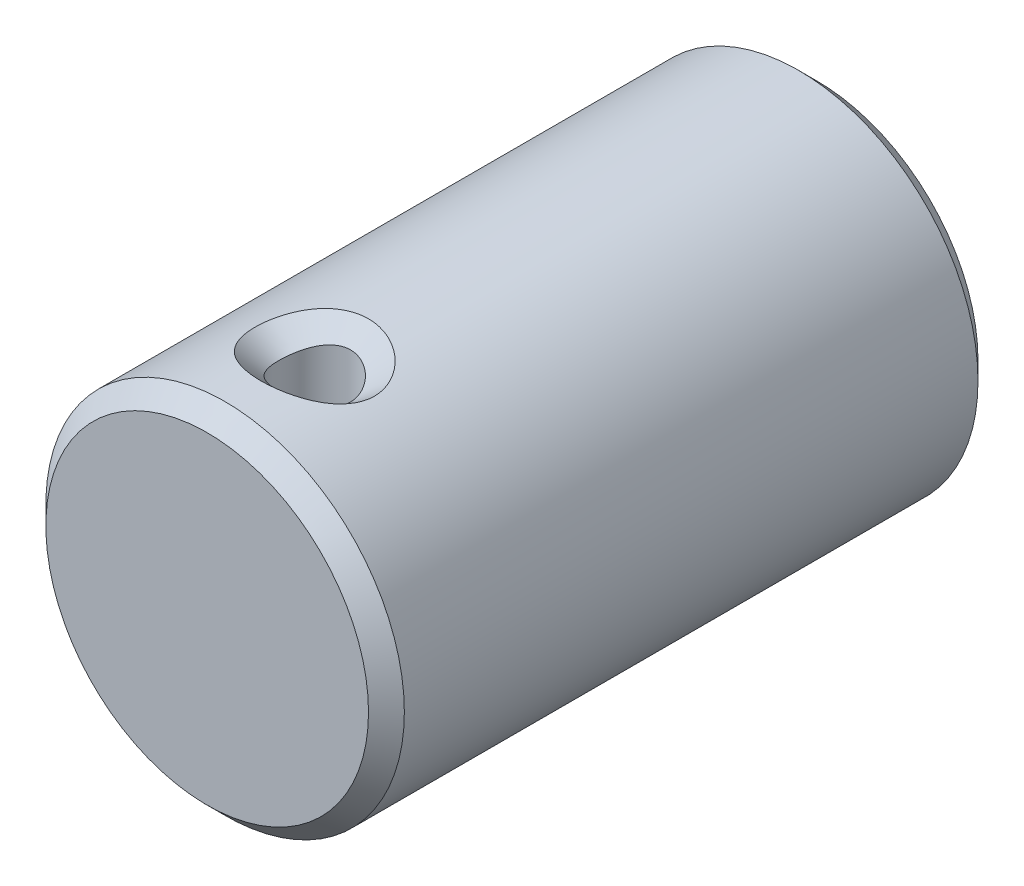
ISO-10303-21;
HEADER;
FILE_DESCRIPTION(('STEP AP214'),'2;1');
FILE_NAME('part.step','',(''),(''),'','','');
FILE_SCHEMA(('AUTOMOTIVE_DESIGN { 1 0 10303 214 1 1 1 1 }'));
ENDSEC;
DATA;
#1=APPLICATION_CONTEXT('core data for automotive mechanical design processes');
#2=APPLICATION_PROTOCOL_DEFINITION('international standard','automotive_design',2000,#1);
#3=PRODUCT_CONTEXT('',#1,'mechanical');
#4=PRODUCT('Part','Part','',(#3));
#5=PRODUCT_RELATED_PRODUCT_CATEGORY('part','',(#4));
#6=PRODUCT_DEFINITION_FORMATION('','',#4);
#7=PRODUCT_DEFINITION_CONTEXT('part definition',#1,'design');
#8=PRODUCT_DEFINITION('design','',#6,#7);
#9=PRODUCT_DEFINITION_SHAPE('','',#8);
#10=(LENGTH_UNIT() NAMED_UNIT(*) SI_UNIT(.MILLI.,.METRE.));
#11=(NAMED_UNIT(*) PLANE_ANGLE_UNIT() SI_UNIT($,.RADIAN.));
#12=(NAMED_UNIT(*) SI_UNIT($,.STERADIAN.) SOLID_ANGLE_UNIT());
#13=UNCERTAINTY_MEASURE_WITH_UNIT(LENGTH_MEASURE(1.E-05),#10,'distance_accuracy_value','');
#14=(GEOMETRIC_REPRESENTATION_CONTEXT(3) GLOBAL_UNCERTAINTY_ASSIGNED_CONTEXT((#13)) GLOBAL_UNIT_ASSIGNED_CONTEXT((#10,
#11,#12)) REPRESENTATION_CONTEXT('',''));
#15=CARTESIAN_POINT('',(0.,0.,0.));
#16=DIRECTION('',(0.,0.,1.));
#17=DIRECTION('',(1.,0.,0.));
#18=AXIS2_PLACEMENT_3D('',#15,#16,#17);
#19=CARTESIAN_POINT('',(0.,0.,-17.0000000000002));
#20=DIRECTION('',(0.,0.,1.00000000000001));
#21=DIRECTION('',(1.,0.,0.));
#22=AXIS2_PLACEMENT_3D('',#19,#20,#21);
#23=CYLINDRICAL_SURFACE('',#22,5.);
#24=CARTESIAN_POINT('',(0.,-5.00000000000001,-1.50000002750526));
#25=CARTESIAN_POINT('',(-0.0275361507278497,-5.00000704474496,-1.49997767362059));
#26=CARTESIAN_POINT('',(-0.055071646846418,-4.99975839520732,-1.50059767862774));
#27=CARTESIAN_POINT('',(-0.110011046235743,-4.99877493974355,-1.50310134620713));
#28=CARTESIAN_POINT('',(-0.137415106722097,-4.99804128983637,-1.50498200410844));
#29=CARTESIAN_POINT('',(-0.192034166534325,-4.9961149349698,-1.50998062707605));
#30=CARTESIAN_POINT('',(-0.219249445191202,-4.99492321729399,-1.51309593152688));
#31=CARTESIAN_POINT('',(-0.273434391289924,-4.99210797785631,-1.52053725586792));
#32=CARTESIAN_POINT('',(-0.300404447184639,-4.99048534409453,-1.52486078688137));
#33=CARTESIAN_POINT('',(-0.354042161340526,-4.9868353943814,-1.5346922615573));
#34=CARTESIAN_POINT('',(-0.380710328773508,-4.98480892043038,-1.54019774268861));
#35=CARTESIAN_POINT('',(-0.433687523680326,-4.98037837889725,-1.55236692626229));
#36=CARTESIAN_POINT('',(-0.459997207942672,-4.97797514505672,-1.55902807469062));
#37=CARTESIAN_POINT('',(-0.512200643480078,-4.97281813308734,-1.57348252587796));
#38=CARTESIAN_POINT('',(-0.538095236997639,-4.97006520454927,-1.58127309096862));
#39=CARTESIAN_POINT('',(-0.589411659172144,-4.96423583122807,-1.59796039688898));
#40=CARTESIAN_POINT('',(-0.614834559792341,-4.96116026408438,-1.60685414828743));
#41=CARTESIAN_POINT('',(-0.665150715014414,-4.95471263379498,-1.62572191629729));
#42=CARTESIAN_POINT('',(-0.69004531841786,-4.95134147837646,-1.63569264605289));
#43=CARTESIAN_POINT('',(-0.739247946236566,-4.94432968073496,-1.65668850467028));
#44=CARTESIAN_POINT('',(-0.76355764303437,-4.94068996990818,-1.66771002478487));
#45=CARTESIAN_POINT('',(-0.811533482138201,-4.9331681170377,-1.69078162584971));
#46=CARTESIAN_POINT('',(-0.835201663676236,-4.92928691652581,-1.70282777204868));
#47=CARTESIAN_POINT('',(-0.881837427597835,-4.92130900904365,-1.72792278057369));
#48=CARTESIAN_POINT('',(-0.904807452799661,-4.91721323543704,-1.74096739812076));
#49=CARTESIAN_POINT('',(-0.949989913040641,-4.90883366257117,-1.76803353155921));
#50=CARTESIAN_POINT('',(-0.972205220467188,-4.9045507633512,-1.78205052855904));
#51=CARTESIAN_POINT('',(-1.01582089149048,-4.89582245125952,-1.81103541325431));
#52=CARTESIAN_POINT('',(-1.03722457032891,-4.89137788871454,-1.82599856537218));
#53=CARTESIAN_POINT('',(-1.07916086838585,-4.88235916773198,-1.85685027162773));
#54=CARTESIAN_POINT('',(-1.09969723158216,-4.87778574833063,-1.87273394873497));
#55=CARTESIAN_POINT('',(-1.13983816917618,-4.86851490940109,-1.90539901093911));
#56=CARTESIAN_POINT('',(-1.15944690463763,-4.86381822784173,-1.92217548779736));
#57=CARTESIAN_POINT('',(-1.19768559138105,-4.8544086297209,-1.95660314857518));
#58=CARTESIAN_POINT('',(-1.21632012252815,-4.84969592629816,-1.97424930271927));
#59=CARTESIAN_POINT('',(-1.25259102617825,-4.84036657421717,-2.01036935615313));
#60=CARTESIAN_POINT('',(-1.27023217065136,-4.83574954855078,-2.02883836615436));
#61=CARTESIAN_POINT('',(-1.30448434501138,-4.82662123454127,-2.0665526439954));
#62=CARTESIAN_POINT('',(-1.32110025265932,-4.82210952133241,-2.08579337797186));
#63=CARTESIAN_POINT('',(-1.35327458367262,-4.81322849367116,-2.12500182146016));
#64=CARTESIAN_POINT('',(-1.36883797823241,-4.80885856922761,-2.14496531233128));
#65=CARTESIAN_POINT('',(-1.39887867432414,-4.80029060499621,-2.18556944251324));
#66=CARTESIAN_POINT('',(-1.41336104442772,-4.79609181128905,-2.20620617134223));
#67=CARTESIAN_POINT('',(-1.44121141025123,-4.78789749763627,-2.24810711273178));
#68=CARTESIAN_POINT('',(-1.45458454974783,-4.78390107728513,-2.26936772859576));
#69=CARTESIAN_POINT('',(-1.48018810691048,-4.77614238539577,-2.31246673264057));
#70=CARTESIAN_POINT('',(-1.4924237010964,-4.77237908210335,-2.33430185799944));
#71=CARTESIAN_POINT('',(-1.51572388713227,-4.76511762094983,-2.37850016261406));
#72=CARTESIAN_POINT('',(-1.52679361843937,-4.76161832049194,-2.40086044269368));
#73=CARTESIAN_POINT('',(-1.54773386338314,-4.75491580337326,-2.44605930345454));
#74=CARTESIAN_POINT('',(-1.55760937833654,-4.75171136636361,-2.46889538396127));
#75=CARTESIAN_POINT('',(-1.57613308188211,-4.74562948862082,-2.51499607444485));
#76=CARTESIAN_POINT('',(-1.58478599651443,-4.74275079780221,-2.53825861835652));
#77=CARTESIAN_POINT('',(-1.60083652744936,-4.73735127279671,-2.58516237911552));
#78=CARTESIAN_POINT('',(-1.60823841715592,-4.73482922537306,-2.60880199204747));
#79=CARTESIAN_POINT('',(-1.62175912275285,-4.73017377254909,-2.65641020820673));
#80=CARTESIAN_POINT('',(-1.62788153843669,-4.72803927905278,-2.68037768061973));
#81=CARTESIAN_POINT('',(-1.63881569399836,-4.72418964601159,-2.72859119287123));
#82=CARTESIAN_POINT('',(-1.64363009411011,-4.72247365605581,-2.75283656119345));
#83=CARTESIAN_POINT('',(-1.6519210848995,-4.71949155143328,-2.80155819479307));
#84=CARTESIAN_POINT('',(-1.65539908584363,-4.7182249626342,-2.82603418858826));
#85=CARTESIAN_POINT('',(-1.65959184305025,-4.71668555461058,-2.86287604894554));
#86=CARTESIAN_POINT('',(-1.66081873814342,-4.7162324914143,-2.87517827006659));
#87=CARTESIAN_POINT('',(-1.66292813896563,-4.71545017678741,-2.89982157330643));
#88=CARTESIAN_POINT('',(-1.66381050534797,-4.71512097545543,-2.91216266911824));
#89=CARTESIAN_POINT('',(-1.66522728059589,-4.71459025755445,-2.93687703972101));
#90=CARTESIAN_POINT('',(-1.66576142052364,-4.71438883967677,-2.94925033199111));
#91=CARTESIAN_POINT('',(-1.6664785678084,-4.7141173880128,-2.97402305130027));
#92=CARTESIAN_POINT('',(-1.66666116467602,-4.71404750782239,-2.98642249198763));
#93=CARTESIAN_POINT('',(-1.66667105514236,-4.71404330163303,-3.01122337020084));
#94=CARTESIAN_POINT('',(-1.66649829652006,-4.71410899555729,-3.02362480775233));
#95=CARTESIAN_POINT('',(-1.66579943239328,-4.71437274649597,-3.04840532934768));
#96=CARTESIAN_POINT('',(-1.66527363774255,-4.71457068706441,-3.06078442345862));
#97=CARTESIAN_POINT('',(-1.66387261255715,-4.71509490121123,-3.08551398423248));
#98=CARTESIAN_POINT('',(-1.66299755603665,-4.71542111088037,-3.09786446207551));
#99=CARTESIAN_POINT('',(-1.66090176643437,-4.71619792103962,-3.12252988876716));
#100=CARTESIAN_POINT('',(-1.65968108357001,-4.71664850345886,-3.13484484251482));
#101=CARTESIAN_POINT('',(-1.65550508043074,-4.71818130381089,-3.17173386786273));
#102=CARTESIAN_POINT('',(-1.65203624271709,-4.71944440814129,-3.19624445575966));
#103=CARTESIAN_POINT('',(-1.64376047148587,-4.72242100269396,-3.2450460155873));
#104=CARTESIAN_POINT('',(-1.63895157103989,-4.72413515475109,-3.26933661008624));
#105=CARTESIAN_POINT('',(-1.6280255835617,-4.7279823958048,-3.31764951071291));
#106=CARTESIAN_POINT('',(-1.62190539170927,-4.73011647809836,-3.34167103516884));
#107=CARTESIAN_POINT('',(-1.60838657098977,-4.73477221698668,-3.38939446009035));
#108=CARTESIAN_POINT('',(-1.60098400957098,-4.73729506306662,-3.41309512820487));
#109=CARTESIAN_POINT('',(-1.58492984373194,-4.74269711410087,-3.46012626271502));
#110=CARTESIAN_POINT('',(-1.5762737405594,-4.74557759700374,-3.48345504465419));
#111=CARTESIAN_POINT('',(-1.55774164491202,-4.75166380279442,-3.52969161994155));
#112=CARTESIAN_POINT('',(-1.54786080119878,-4.75487080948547,-3.55259729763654));
#113=CARTESIAN_POINT('',(-1.52690816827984,-4.7615790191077,-3.59793689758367));
#114=CARTESIAN_POINT('',(-1.51583134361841,-4.76508145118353,-3.62036830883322));
#115=CARTESIAN_POINT('',(-1.49251553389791,-4.77234953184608,-3.66470854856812));
#116=CARTESIAN_POINT('',(-1.48027145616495,-4.77611631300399,-3.6866145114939));
#117=CARTESIAN_POINT('',(-1.45464980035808,-4.78388211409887,-3.72985298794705));
#118=CARTESIAN_POINT('',(-1.44126716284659,-4.7878821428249,-3.75118232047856));
#119=CARTESIAN_POINT('',(-1.41339697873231,-4.79608361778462,-3.79321660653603));
#120=CARTESIAN_POINT('',(-1.39890446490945,-4.80028593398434,-3.81391809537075));
#121=CARTESIAN_POINT('',(-1.36884300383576,-4.80886067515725,-3.85464579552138));
#122=CARTESIAN_POINT('',(-1.35326921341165,-4.81323382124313,-3.87466827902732));
#123=CARTESIAN_POINT('',(-1.32107387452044,-4.82212080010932,-3.91398679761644));
#124=CARTESIAN_POINT('',(-1.30444761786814,-4.82663521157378,-3.93327884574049));
#125=CARTESIAN_POINT('',(-1.2701751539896,-4.83576822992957,-3.97108625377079));
#126=CARTESIAN_POINT('',(-1.25252436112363,-4.84038723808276,-3.98959735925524));
#127=CARTESIAN_POINT('',(-1.21623387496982,-4.84971954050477,-4.02578912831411));
#128=CARTESIAN_POINT('',(-1.19758971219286,-4.85443318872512,-4.04346521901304));
#129=CARTESIAN_POINT('',(-1.15933702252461,-4.86384353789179,-4.07794142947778));
#130=CARTESIAN_POINT('',(-1.13972430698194,-4.86854004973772,-4.09473695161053));
#131=CARTESIAN_POINT('',(-1.09958492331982,-4.8778095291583,-4.12743232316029));
#132=CARTESIAN_POINT('',(-1.07905449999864,-4.88238183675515,-4.14332774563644));
#133=CARTESIAN_POINT('',(-1.03713731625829,-4.89139740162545,-4.17419521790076));
#134=CARTESIAN_POINT('',(-1.01574712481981,-4.8958399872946,-4.18916280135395));
#135=CARTESIAN_POINT('',(-0.972164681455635,-4.90456366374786,-4.21815033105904));
#136=CARTESIAN_POINT('',(-0.949969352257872,-4.90884397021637,-4.23216588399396));
#137=CARTESIAN_POINT('',(-0.904831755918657,-4.91721788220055,-4.25922403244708));
#138=CARTESIAN_POINT('',(-0.881886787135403,-4.9213106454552,-4.27226237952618));
#139=CARTESIAN_POINT('',(-0.835304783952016,-4.92928228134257,-4.29734097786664));
#140=CARTESIAN_POINT('',(-0.811665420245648,-4.93316026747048,-4.30937718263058));
#141=CARTESIAN_POINT('',(-0.763749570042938,-4.94067566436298,-4.3324262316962));
#142=CARTESIAN_POINT('',(-0.739471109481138,-4.94431216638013,-4.34343526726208));
#143=CARTESIAN_POINT('',(-0.69033201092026,-4.95131774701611,-4.36440469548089));
#144=CARTESIAN_POINT('',(-0.665469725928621,-4.95468591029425,-4.37436153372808));
#145=CARTESIAN_POINT('',(-0.615217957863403,-4.96112798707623,-4.39320126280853));
#146=CARTESIAN_POINT('',(-0.589827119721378,-4.96420098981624,-4.40208085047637));
#147=CARTESIAN_POINT('',(-0.538573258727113,-4.97002589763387,-4.41874077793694));
#148=CARTESIAN_POINT('',(-0.512709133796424,-4.97277690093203,-4.42651804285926));
#149=CARTESIAN_POINT('',(-0.460563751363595,-4.97793096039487,-4.4409480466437));
#150=CARTESIAN_POINT('',(-0.43428160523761,-4.98033312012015,-4.44759789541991));
#151=CARTESIAN_POINT('',(-0.381355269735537,-4.98476264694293,-4.45974783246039));
#152=CARTESIAN_POINT('',(-0.35471036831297,-4.98678910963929,-4.46524515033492));
#153=CARTESIAN_POINT('',(-0.301113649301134,-4.99044040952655,-4.4750648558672));
#154=CARTESIAN_POINT('',(-0.274161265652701,-4.99206430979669,-4.47938450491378));
#155=CARTESIAN_POINT('',(-0.22000472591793,-4.99488368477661,-4.48682379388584));
#156=CARTESIAN_POINT('',(-0.192800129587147,-4.99607815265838,-4.4899406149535));
#157=CARTESIAN_POINT('',(-0.138194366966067,-4.99801187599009,-4.49494927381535));
#158=CARTESIAN_POINT('',(-0.110792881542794,-4.99875000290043,-4.4968380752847));
#159=CARTESIAN_POINT('',(-0.0558483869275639,-4.99974440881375,-4.49936589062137));
#160=CARTESIAN_POINT('',(-0.0283051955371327,-4.99999937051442,-4.50000148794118));
#161=CARTESIAN_POINT('',(0.0267863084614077,-5.00000051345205,-4.49999814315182));
#162=CARTESIAN_POINT('',(0.0543346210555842,-4.9997465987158,-4.49935896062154));
#163=CARTESIAN_POINT('',(0.109298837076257,-4.99875389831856,-4.49682424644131));
#164=CARTESIAN_POINT('',(0.136714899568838,-4.99801626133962,-4.4949316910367));
#165=CARTESIAN_POINT('',(0.191358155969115,-4.99608330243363,-4.48991583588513));
#166=CARTESIAN_POINT('',(0.218585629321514,-4.99488896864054,-4.4867951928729));
#167=CARTESIAN_POINT('',(0.272795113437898,-4.9920696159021,-4.47934852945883));
#168=CARTESIAN_POINT('',(0.299777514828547,-4.99044549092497,-4.47502501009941));
#169=CARTESIAN_POINT('',(0.353440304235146,-4.98679352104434,-4.46519781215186));
#170=CARTESIAN_POINT('',(0.380121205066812,-4.98476652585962,-4.45969661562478));
#171=CARTESIAN_POINT('',(0.433124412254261,-4.9803357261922,-4.44753914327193));
#172=CARTESIAN_POINT('',(0.459447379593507,-4.97793276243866,-4.44088544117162));
#173=CARTESIAN_POINT('',(0.511678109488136,-4.97277690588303,-4.42644792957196));
#174=CARTESIAN_POINT('',(0.537586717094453,-4.97002486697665,-4.41866687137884));
#175=CARTESIAN_POINT('',(0.588932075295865,-4.96419771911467,-4.40199953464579));
#176=CARTESIAN_POINT('',(0.614369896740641,-4.96112348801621,-4.39311624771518));
#177=CARTESIAN_POINT('',(0.66471698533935,-4.95467880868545,-4.37426927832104));
#178=CARTESIAN_POINT('',(0.689627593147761,-4.95130926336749,-4.36430886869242));
#179=CARTESIAN_POINT('',(0.738863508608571,-4.9443007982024,-4.34333243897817));
#180=CARTESIAN_POINT('',(0.763190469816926,-4.9406627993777,-4.33231999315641));
#181=CARTESIAN_POINT('',(0.811202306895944,-4.93314431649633,-4.30926425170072));
#182=CARTESIAN_POINT('',(0.834889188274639,-4.92926475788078,-4.29722483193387));
#183=CARTESIAN_POINT('',(0.881564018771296,-4.92128991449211,-4.27213991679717));
#184=CARTESIAN_POINT('',(0.904554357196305,-4.91719554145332,-4.25909857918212));
#185=CARTESIAN_POINT('',(0.949779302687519,-4.90881838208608,-4.23203456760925));
#186=CARTESIAN_POINT('',(0.972016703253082,-4.90453646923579,-4.21801629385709));
#187=CARTESIAN_POINT('',(1.01567865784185,-4.89580958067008,-4.18902338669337));
#188=CARTESIAN_POINT('',(1.03710641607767,-4.89136542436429,-4.17405333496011));
#189=CARTESIAN_POINT('',(1.07909306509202,-4.88234677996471,-4.14318117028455));
#190=CARTESIAN_POINT('',(1.09965555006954,-4.877772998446,-4.12728374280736));
#191=CARTESIAN_POINT('',(1.13985158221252,-4.86850059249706,-4.09458393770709));
#192=CARTESIAN_POINT('',(1.15948908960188,-4.86380266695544,-4.07778623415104));
#193=CARTESIAN_POINT('',(1.1977819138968,-4.85439056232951,-4.0433104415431));
#194=CARTESIAN_POINT('',(1.21644178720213,-4.84967659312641,-4.02563735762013));
#195=CARTESIAN_POINT('',(1.25275417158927,-4.84034556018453,-3.98946068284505));
#196=CARTESIAN_POINT('',(1.27041163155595,-4.83572810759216,-3.97096215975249));
#197=CARTESIAN_POINT('',(1.30468880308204,-4.82659970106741,-3.93318735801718));
#198=CARTESIAN_POINT('',(1.32131354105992,-4.82208831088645,-3.91391574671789));
#199=CARTESIAN_POINT('',(1.35349890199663,-4.81320853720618,-3.87464472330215));
#200=CARTESIAN_POINT('',(1.36906462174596,-4.80883953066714,-3.85464963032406));
#201=CARTESIAN_POINT('',(1.39910448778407,-4.80027387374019,-3.81398228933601));
#202=CARTESIAN_POINT('',(1.41358380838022,-4.79607645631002,-3.79331402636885));
#203=CARTESIAN_POINT('',(1.44142370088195,-4.7878852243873,-3.75135078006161));
#204=CARTESIAN_POINT('',(1.4547895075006,-4.78389049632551,-3.73005944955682));
#205=CARTESIAN_POINT('',(1.48037513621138,-4.7761353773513,-3.68690055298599));
#206=CARTESIAN_POINT('',(1.49260021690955,-4.7723739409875,-3.66503629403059));
#207=CARTESIAN_POINT('',(1.51587721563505,-4.76511626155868,-3.62078202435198));
#208=CARTESIAN_POINT('',(1.52693435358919,-4.76161886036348,-3.59839495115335));
#209=CARTESIAN_POINT('',(1.54784834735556,-4.75492005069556,-3.55314556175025));
#210=CARTESIAN_POINT('',(1.55771029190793,-4.75171740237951,-3.53028578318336));
#211=CARTESIAN_POINT('',(1.5762068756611,-4.74563887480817,-3.48414152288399));
#212=CARTESIAN_POINT('',(1.58484634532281,-4.74276171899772,-3.46085914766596));
#213=CARTESIAN_POINT('',(1.60087108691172,-4.73736490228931,-3.41392024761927));
#214=CARTESIAN_POINT('',(1.60826076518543,-4.73484399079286,-3.39026537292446));
#215=CARTESIAN_POINT('',(1.62175919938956,-4.73019032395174,-3.34263210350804));
#216=CARTESIAN_POINT('',(1.62787172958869,-4.72805642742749,-3.31865489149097));
#217=CARTESIAN_POINT('',(1.63878936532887,-4.72420736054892,-3.2704273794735));
#218=CARTESIAN_POINT('',(1.64359736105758,-4.72249126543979,-3.24617780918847));
#219=CARTESIAN_POINT('',(1.65187964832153,-4.71950827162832,-3.19745674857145));
#220=CARTESIAN_POINT('',(1.65535565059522,-4.71824079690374,-3.17298558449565));
#221=CARTESIAN_POINT('',(1.66094810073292,-4.71618533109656,-3.12386962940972));
#222=CARTESIAN_POINT('',(1.66306474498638,-4.71539727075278,-3.09922486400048));
#223=CARTESIAN_POINT('',(1.66519985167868,-4.71459777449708,-3.06218365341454));
#224=CARTESIAN_POINT('',(1.66573825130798,-4.71439503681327,-3.0498190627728));
#225=CARTESIAN_POINT('',(1.66646586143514,-4.71412062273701,-3.02506555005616));
#226=CARTESIAN_POINT('',(1.66665472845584,-4.71404907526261,-3.01267661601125));
#227=CARTESIAN_POINT('',(1.6666784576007,-4.71404139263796,-2.98789810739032));
#228=CARTESIAN_POINT('',(1.66651331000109,-4.71410526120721,-2.97550853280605));
#229=CARTESIAN_POINT('',(1.66583023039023,-4.7143653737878,-2.95075199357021));
#230=CARTESIAN_POINT('',(1.66531262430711,-4.71456149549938,-2.93838501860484));
#231=CARTESIAN_POINT('',(1.66392863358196,-4.71508204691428,-2.91367996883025));
#232=CARTESIAN_POINT('',(1.66306243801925,-4.71540640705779,-2.90134188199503));
#233=CARTESIAN_POINT('',(1.66098488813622,-4.71617951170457,-2.87670148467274));
#234=CARTESIAN_POINT('',(1.6597735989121,-4.71662823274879,-2.86439916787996));
#235=CARTESIAN_POINT('',(1.65562652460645,-4.71815541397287,-2.82754915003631));
#236=CARTESIAN_POINT('',(1.65217787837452,-4.7194147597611,-2.80306449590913));
#237=CARTESIAN_POINT('',(1.64394346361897,-4.72238390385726,-2.75431558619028));
#238=CARTESIAN_POINT('',(1.63915582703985,-4.72409433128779,-2.73005168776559));
#239=CARTESIAN_POINT('',(1.62827264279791,-4.72793423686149,-2.68179283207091));
#240=CARTESIAN_POINT('',(1.6221740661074,-4.73006468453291,-2.65779863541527));
#241=CARTESIAN_POINT('',(1.60869805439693,-4.73471331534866,-2.61013037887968));
#242=CARTESIAN_POINT('',(1.60131673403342,-4.73723267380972,-2.58645753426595));
#243=CARTESIAN_POINT('',(1.58530393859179,-4.74262795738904,-2.53948241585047));
#244=CARTESIAN_POINT('',(1.57666797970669,-4.74550515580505,-2.51618181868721));
#245=CARTESIAN_POINT('',(1.55817437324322,-4.7515850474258,-2.47000183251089));
#246=CARTESIAN_POINT('',(1.54831185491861,-4.75478902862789,-2.44712456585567));
#247=CARTESIAN_POINT('',(1.52739338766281,-4.76149148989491,-2.40184185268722));
#248=CARTESIAN_POINT('',(1.51633234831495,-4.76499121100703,-2.37943894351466));
#249=CARTESIAN_POINT('',(1.49304493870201,-4.77225422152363,-2.33515561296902));
#250=CARTESIAN_POINT('',(1.48081338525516,-4.7760186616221,-2.31327810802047));
#251=CARTESIAN_POINT('',(1.45521292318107,-4.78378018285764,-2.27009628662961));
#252=CARTESIAN_POINT('',(1.44183882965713,-4.78777829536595,-2.24879523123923));
#253=CARTESIAN_POINT('',(1.41398118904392,-4.79597639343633,-2.20681707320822));
#254=CARTESIAN_POINT('',(1.39949251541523,-4.80017727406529,-2.18614354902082));
#255=CARTESIAN_POINT('',(1.36943351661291,-4.80874965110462,-2.14547116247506));
#256=CARTESIAN_POINT('',(1.3538581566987,-4.81312189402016,-2.12547617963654));
#257=CARTESIAN_POINT('',(1.32165372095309,-4.82200764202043,-2.08621192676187));
#258=CARTESIAN_POINT('',(1.30501971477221,-4.82652174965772,-2.06694683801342));
#259=CARTESIAN_POINT('',(1.27072529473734,-4.83565474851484,-2.02919221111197));
#260=CARTESIAN_POINT('',(1.25306004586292,-4.84027405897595,-2.01070716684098));
#261=CARTESIAN_POINT('',(1.21673277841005,-4.84960779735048,-1.97456702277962));
#262=CARTESIAN_POINT('',(1.19806601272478,-4.85432259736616,-1.95691679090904));
#263=CARTESIAN_POINT('',(1.15976227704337,-4.86373542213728,-1.92248850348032));
#264=CARTESIAN_POINT('',(1.14012083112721,-4.86843323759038,-1.90571537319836));
#265=CARTESIAN_POINT('',(1.09992112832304,-4.8777050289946,-1.87305779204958));
#266=CARTESIAN_POINT('',(1.07935887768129,-4.88227829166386,-1.8571780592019));
#267=CARTESIAN_POINT('',(1.03737529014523,-4.89129573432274,-1.82633629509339));
#268=CARTESIAN_POINT('',(1.01595033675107,-4.89573919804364,-1.81137898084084));
#269=CARTESIAN_POINT('',(0.972296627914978,-4.90446461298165,-1.7824065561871));
#270=CARTESIAN_POINT('',(0.950064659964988,-4.9087457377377,-1.76839604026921));
#271=CARTESIAN_POINT('',(0.904852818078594,-4.91712135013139,-1.74134306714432));
#272=CARTESIAN_POINT('',(0.88187015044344,-4.92121496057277,-1.72830500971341));
#273=CARTESIAN_POINT('',(0.835212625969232,-4.92918841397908,-1.70322254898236));
#274=CARTESIAN_POINT('',(0.811535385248,-4.93306734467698,-1.69118229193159));
#275=CARTESIAN_POINT('',(0.763544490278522,-4.94058481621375,-1.66812117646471));
#276=CARTESIAN_POINT('',(0.739228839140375,-4.94422243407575,-1.65710417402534));
#277=CARTESIAN_POINT('',(0.690016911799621,-4.95123049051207,-1.63611532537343));
#278=CARTESIAN_POINT('',(0.665118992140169,-4.9546000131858,-1.62614702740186));
#279=CARTESIAN_POINT('',(0.614798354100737,-4.96104510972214,-1.60728136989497));
#280=CARTESIAN_POINT('',(0.589374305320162,-4.9641197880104,-1.5983872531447));
#281=CARTESIAN_POINT('',(0.538057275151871,-4.96994840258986,-1.58169573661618));
#282=CARTESIAN_POINT('',(0.512163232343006,-4.97270147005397,-1.5739012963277));
#283=CARTESIAN_POINT('',(0.459962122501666,-4.97786006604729,-1.55943489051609));
#284=CARTESIAN_POINT('',(0.433654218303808,-4.98026475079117,-1.5527656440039));
#285=CARTESIAN_POINT('',(0.380681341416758,-4.98469978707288,-1.54057533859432));
#286=CARTESIAN_POINT('',(0.354015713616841,-4.98672930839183,-1.53505682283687));
#287=CARTESIAN_POINT('',(0.300383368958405,-4.99038723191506,-1.52519363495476));
#288=CARTESIAN_POINT('',(0.273416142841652,-4.99201479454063,-1.52085141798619));
#289=CARTESIAN_POINT('',(0.219236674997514,-4.99484205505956,-1.51336636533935));
#290=CARTESIAN_POINT('',(0.192024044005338,-4.99604086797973,-1.51022600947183));
#291=CARTESIAN_POINT('',(0.137409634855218,-4.9979838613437,-1.50517021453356));
#292=CARTESIAN_POINT('',(0.110007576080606,-4.99872706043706,-1.50325741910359));
#293=CARTESIAN_POINT('',(0.0550710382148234,-4.9997323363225,-1.50068172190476));
#294=CARTESIAN_POINT('',(0.027536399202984,-4.99999326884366,-1.50002179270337));
#295=CARTESIAN_POINT('',(0.,-5.00000000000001,-1.50000002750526));
#296=B_SPLINE_CURVE_WITH_KNOTS('',3,(#24,#25,#26,#27,#28,#29,#30,#31,#32,#33,#34,#35,#36,#37,
#38,#39,#40,#41,#42,#43,#44,#45,#46,#47,#48,#49,#50,#51,#52,#53,#54,#55,#56,#57,#58,#59,#60,#61,
#62,#63,#64,#65,#66,#67,#68,#69,#70,#71,#72,#73,#74,#75,#76,#77,#78,#79,#80,#81,#82,#83,#84,#85,
#86,#87,#88,#89,#90,#91,#92,#93,#94,#95,#96,#97,#98,#99,#100,#101,#102,#103,#104,#105,#106,#107,
#108,#109,#110,#111,#112,#113,#114,#115,#116,#117,#118,#119,#120,#121,#122,#123,#124,#125,#126,
#127,#128,#129,#130,#131,#132,#133,#134,#135,#136,#137,#138,#139,#140,#141,#142,#143,#144,#145,
#146,#147,#148,#149,#150,#151,#152,#153,#154,#155,#156,#157,#158,#159,#160,#161,#162,#163,#164,
#165,#166,#167,#168,#169,#170,#171,#172,#173,#174,#175,#176,#177,#178,#179,#180,#181,#182,#183,
#184,#185,#186,#187,#188,#189,#190,#191,#192,#193,#194,#195,#196,#197,#198,#199,#200,#201,#202,
#203,#204,#205,#206,#207,#208,#209,#210,#211,#212,#213,#214,#215,#216,#217,#218,#219,#220,#221,
#222,#223,#224,#225,#226,#227,#228,#229,#230,#231,#232,#233,#234,#235,#236,#237,#238,#239,#240,
#241,#242,#243,#244,#245,#246,#247,#248,#249,#250,#251,#252,#253,#254,#255,#256,#257,#258,#259,
#260,#261,#262,#263,#264,#265,#266,#267,#268,#269,#270,#271,#272,#273,#274,#275,#276,#277,#278,
#279,#280,#281,#282,#283,#284,#285,#286,#287,#288,#289,#290,#291,#292,#293,#294,#295),
.UNSPECIFIED.,.F.,.F.,(4,2,2,2,2,2,2,2,2,2,2,2,2,2,2,2,2,2,2,2,2,2,2,2,2,2,2,2,2,2,2,2,2,2,2,2,
2,2,2,2,2,2,2,2,2,2,2,2,2,2,2,2,2,2,2,2,2,2,2,2,2,2,2,2,2,2,2,2,2,2,2,2,2,2,2,2,2,2,2,2,2,2,2,2,
2,2,2,2,2,2,2,2,2,2,2,2,2,2,2,2,2,2,2,2,2,2,2,2,2,2,2,2,2,2,2,2,2,2,2,2,2,2,2,2,2,2,2,2,2,2,2,2,
2,2,2,4),(0.,0.0825980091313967,0.16499984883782,0.247225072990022,0.329282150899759,
0.411169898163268,0.492878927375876,0.574393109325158,0.65569104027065,0.736747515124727,
0.817535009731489,0.898025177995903,0.978190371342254,1.05800518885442,1.13744806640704,
1.21650291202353,1.29516079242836,1.37340757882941,1.45123915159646,1.52866616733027,
1.6056974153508,1.68234125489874,1.7586070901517,1.83450688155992,1.9100566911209,
1.9852782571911,2.06020059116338,2.13486158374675,2.20930960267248,2.28360505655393,
2.35782189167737,2.39493204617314,2.43205719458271,2.46921098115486,2.50640812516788,
2.54361073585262,2.58078063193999,2.61793203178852,2.65507803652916,2.72939299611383,
2.8038176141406,2.8784204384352,2.95325622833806,3.02836757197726,3.10378655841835,
3.17953647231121,3.25563348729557,3.33208834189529,3.40890798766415,3.48609720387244,
3.56366017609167,3.64160203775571,3.71993037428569,3.79863361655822,3.8776952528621,
3.9571118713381,4.03687305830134,4.11696300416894,4.19736206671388,4.2780482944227,
4.35899891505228,4.44019179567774,4.52160688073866,4.60322761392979,4.68504234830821,
4.76704574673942,4.84924017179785,4.93163706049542,5.01425827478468,5.0968950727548,
5.17933634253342,5.26160023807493,5.34369435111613,5.42561711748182,5.50735924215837,
5.58890513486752,5.6702343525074,5.75132304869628,5.83214543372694,5.9126752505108,
5.99288727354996,6.07275883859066,6.15227141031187,6.23141219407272,6.31017579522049,
6.38853184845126,6.46645959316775,6.54397227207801,6.62108076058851,6.69779499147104,
6.7741254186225,6.85008451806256,6.92568832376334,7.00095799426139,7.07592140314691,
7.15061474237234,7.22508412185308,7.29938714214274,7.37359440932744,7.447790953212,
7.48492023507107,7.52208598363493,7.55925275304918,7.59638519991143,7.63349753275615,
7.67060286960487,7.74483189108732,7.81916499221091,7.89367172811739,7.96840820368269,
8.04341865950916,8.11873711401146,8.19438902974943,8.27039298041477,8.34676230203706,
8.42350671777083,8.50063392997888,8.57815117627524,8.65606674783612,8.73439146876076,
8.81311699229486,8.89222533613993,8.97170941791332,9.05155499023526,9.13174228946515,
9.21224763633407,9.29304499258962,9.37410748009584,9.45540886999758,9.53692504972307,
9.61863547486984,9.70052461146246,9.78258337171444,9.86481054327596,9.94721420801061,
10.0298131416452),.UNSPECIFIED.);
#297=CARTESIAN_POINT('',(0.,-5.00000000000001,-1.50000002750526));
#298=VERTEX_POINT('',#297);
#299=EDGE_CURVE('E106',#298,#298,#296,.F.);
#300=ORIENTED_EDGE('',*,*,#299,.T.);
#301=EDGE_LOOP('',(#300));
#302=FACE_BOUND('',#301,.T.);
#303=CARTESIAN_POINT('',(0.,5.00000000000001,-1.50000002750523));
#304=CARTESIAN_POINT('',(0.0275361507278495,5.00000704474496,-1.49997767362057));
#305=CARTESIAN_POINT('',(0.0550716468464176,4.99975839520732,-1.50059767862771));
#306=CARTESIAN_POINT('',(0.110011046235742,4.99877493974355,-1.50310134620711));
#307=CARTESIAN_POINT('',(0.137415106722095,4.99804128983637,-1.50498200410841));
#308=CARTESIAN_POINT('',(0.192034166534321,4.9961149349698,-1.50998062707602));
#309=CARTESIAN_POINT('',(0.219249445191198,4.99492321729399,-1.51309593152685));
#310=CARTESIAN_POINT('',(0.273434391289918,4.99210797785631,-1.5205372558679));
#311=CARTESIAN_POINT('',(0.300404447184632,4.99048534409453,-1.52486078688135));
#312=CARTESIAN_POINT('',(0.354042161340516,4.9868353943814,-1.53469226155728));
#313=CARTESIAN_POINT('',(0.380710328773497,4.98480892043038,-1.54019774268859));
#314=CARTESIAN_POINT('',(0.433687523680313,4.98037837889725,-1.55236692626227));
#315=CARTESIAN_POINT('',(0.459997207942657,4.97797514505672,-1.5590280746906));
#316=CARTESIAN_POINT('',(0.512200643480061,4.97281813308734,-1.57348252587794));
#317=CARTESIAN_POINT('',(0.53809523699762,4.97006520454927,-1.5812730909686));
#318=CARTESIAN_POINT('',(0.589411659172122,4.96423583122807,-1.59796039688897));
#319=CARTESIAN_POINT('',(0.614834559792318,4.96116026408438,-1.60685414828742));
#320=CARTESIAN_POINT('',(0.665150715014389,4.95471263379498,-1.62572191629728));
#321=CARTESIAN_POINT('',(0.690045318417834,4.95134147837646,-1.63569264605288));
#322=CARTESIAN_POINT('',(0.739247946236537,4.94432968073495,-1.65668850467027));
#323=CARTESIAN_POINT('',(0.76355764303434,4.94068996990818,-1.66771002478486));
#324=CARTESIAN_POINT('',(0.811533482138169,4.9331681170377,-1.6907816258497));
#325=CARTESIAN_POINT('',(0.835201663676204,4.92928691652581,-1.70282777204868));
#326=CARTESIAN_POINT('',(0.881837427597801,4.92130900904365,-1.72792278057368));
#327=CARTESIAN_POINT('',(0.904807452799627,4.91721323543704,-1.74096739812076));
#328=CARTESIAN_POINT('',(0.949989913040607,4.90883366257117,-1.76803353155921));
#329=CARTESIAN_POINT('',(0.972205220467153,4.9045507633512,-1.78205052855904));
#330=CARTESIAN_POINT('',(1.01582089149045,4.89582245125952,-1.81103541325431));
#331=CARTESIAN_POINT('',(1.03722457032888,4.89137788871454,-1.82599856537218));
#332=CARTESIAN_POINT('',(1.07916086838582,4.88235916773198,-1.85685027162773));
#333=CARTESIAN_POINT('',(1.09969723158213,4.87778574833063,-1.87273394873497));
#334=CARTESIAN_POINT('',(1.13983816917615,4.86851490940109,-1.90539901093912));
#335=CARTESIAN_POINT('',(1.15944690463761,4.86381822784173,-1.92217548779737));
#336=CARTESIAN_POINT('',(1.19768559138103,4.8544086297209,-1.95660314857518));
#337=CARTESIAN_POINT('',(1.21632012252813,4.84969592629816,-1.97424930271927));
#338=CARTESIAN_POINT('',(1.25259102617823,4.84036657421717,-2.01036935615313));
#339=CARTESIAN_POINT('',(1.27023217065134,4.83574954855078,-2.02883836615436));
#340=CARTESIAN_POINT('',(1.30448434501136,4.82662123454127,-2.06655264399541));
#341=CARTESIAN_POINT('',(1.32110025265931,4.82210952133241,-2.08579337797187));
#342=CARTESIAN_POINT('',(1.35327458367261,4.81322849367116,-2.12500182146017));
#343=CARTESIAN_POINT('',(1.3688379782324,4.80885856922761,-2.14496531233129));
#344=CARTESIAN_POINT('',(1.39887867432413,4.80029060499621,-2.18556944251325));
#345=CARTESIAN_POINT('',(1.41336104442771,4.79609181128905,-2.20620617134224));
#346=CARTESIAN_POINT('',(1.44121141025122,4.78789749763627,-2.2481071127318));
#347=CARTESIAN_POINT('',(1.45458454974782,4.78390107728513,-2.26936772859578));
#348=CARTESIAN_POINT('',(1.48018810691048,4.77614238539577,-2.31246673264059));
#349=CARTESIAN_POINT('',(1.49242370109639,4.77237908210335,-2.33430185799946));
#350=CARTESIAN_POINT('',(1.51572388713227,4.76511762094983,-2.37850016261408));
#351=CARTESIAN_POINT('',(1.52679361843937,4.76161832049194,-2.4008604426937));
#352=CARTESIAN_POINT('',(1.54773386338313,4.75491580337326,-2.44605930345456));
#353=CARTESIAN_POINT('',(1.55760937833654,4.75171136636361,-2.4688953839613));
#354=CARTESIAN_POINT('',(1.57613308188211,4.74562948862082,-2.51499607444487));
#355=CARTESIAN_POINT('',(1.58478599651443,4.74275079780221,-2.53825861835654));
#356=CARTESIAN_POINT('',(1.60083652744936,4.73735127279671,-2.58516237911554));
#357=CARTESIAN_POINT('',(1.60823841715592,4.73482922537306,-2.60880199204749));
#358=CARTESIAN_POINT('',(1.62175912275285,4.73017377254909,-2.65641020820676));
#359=CARTESIAN_POINT('',(1.62788153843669,4.72803927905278,-2.68037768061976));
#360=CARTESIAN_POINT('',(1.63881569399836,4.72418964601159,-2.72859119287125));
#361=CARTESIAN_POINT('',(1.64363009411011,4.72247365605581,-2.75283656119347));
#362=CARTESIAN_POINT('',(1.6519210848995,4.71949155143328,-2.80155819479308));
#363=CARTESIAN_POINT('',(1.65539908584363,4.7182249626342,-2.82603418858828));
#364=CARTESIAN_POINT('',(1.65959184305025,4.71668555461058,-2.86287604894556));
#365=CARTESIAN_POINT('',(1.66081873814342,4.7162324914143,-2.87517827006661));
#366=CARTESIAN_POINT('',(1.66292813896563,4.71545017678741,-2.89982157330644));
#367=CARTESIAN_POINT('',(1.66381050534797,4.71512097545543,-2.91216266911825));
#368=CARTESIAN_POINT('',(1.66522728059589,4.71459025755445,-2.93687703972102));
#369=CARTESIAN_POINT('',(1.66576142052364,4.71438883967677,-2.94925033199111));
#370=CARTESIAN_POINT('',(1.6664785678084,4.7141173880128,-2.97402305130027));
#371=CARTESIAN_POINT('',(1.66666116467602,4.71404750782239,-2.98642249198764));
#372=CARTESIAN_POINT('',(1.66667105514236,4.71404330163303,-3.01122337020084));
#373=CARTESIAN_POINT('',(1.66649829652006,4.71410899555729,-3.02362480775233));
#374=CARTESIAN_POINT('',(1.66579943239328,4.71437274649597,-3.04840532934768));
#375=CARTESIAN_POINT('',(1.66527363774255,4.71457068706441,-3.06078442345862));
#376=CARTESIAN_POINT('',(1.66387261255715,4.71509490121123,-3.08551398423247));
#377=CARTESIAN_POINT('',(1.66299755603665,4.71542111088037,-3.0978644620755));
#378=CARTESIAN_POINT('',(1.66090176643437,4.71619792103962,-3.12252988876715));
#379=CARTESIAN_POINT('',(1.65968108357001,4.71664850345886,-3.13484484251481));
#380=CARTESIAN_POINT('',(1.65550508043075,4.71818130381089,-3.17173386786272));
#381=CARTESIAN_POINT('',(1.6520362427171,4.71944440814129,-3.19624445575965));
#382=CARTESIAN_POINT('',(1.64376047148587,4.72242100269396,-3.24504601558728));
#383=CARTESIAN_POINT('',(1.63895157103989,4.72413515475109,-3.26933661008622));
#384=CARTESIAN_POINT('',(1.6280255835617,4.7279823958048,-3.31764951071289));
#385=CARTESIAN_POINT('',(1.62190539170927,4.73011647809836,-3.34167103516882));
#386=CARTESIAN_POINT('',(1.60838657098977,4.73477221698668,-3.38939446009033));
#387=CARTESIAN_POINT('',(1.60098400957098,4.73729506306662,-3.41309512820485));
#388=CARTESIAN_POINT('',(1.58492984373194,4.74269711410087,-3.460126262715));
#389=CARTESIAN_POINT('',(1.5762737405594,4.74557759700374,-3.48345504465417));
#390=CARTESIAN_POINT('',(1.55774164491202,4.75166380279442,-3.52969161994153));
#391=CARTESIAN_POINT('',(1.54786080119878,4.75487080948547,-3.55259729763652));
#392=CARTESIAN_POINT('',(1.52690816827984,4.7615790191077,-3.59793689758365));
#393=CARTESIAN_POINT('',(1.51583134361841,4.76508145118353,-3.6203683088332));
#394=CARTESIAN_POINT('',(1.49251553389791,4.77234953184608,-3.6647085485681));
#395=CARTESIAN_POINT('',(1.48027145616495,4.77611631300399,-3.68661451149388));
#396=CARTESIAN_POINT('',(1.45464980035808,4.78388211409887,-3.72985298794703));
#397=CARTESIAN_POINT('',(1.44126716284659,4.7878821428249,-3.75118232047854));
#398=CARTESIAN_POINT('',(1.41339697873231,4.79608361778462,-3.79321660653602));
#399=CARTESIAN_POINT('',(1.39890446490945,4.80028593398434,-3.81391809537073));
#400=CARTESIAN_POINT('',(1.36884300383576,4.80886067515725,-3.85464579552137));
#401=CARTESIAN_POINT('',(1.35326921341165,4.81323382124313,-3.87466827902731));
#402=CARTESIAN_POINT('',(1.32107387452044,4.82212080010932,-3.91398679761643));
#403=CARTESIAN_POINT('',(1.30444761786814,4.82663521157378,-3.93327884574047));
#404=CARTESIAN_POINT('',(1.2701751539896,4.83576822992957,-3.97108625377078));
#405=CARTESIAN_POINT('',(1.25252436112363,4.84038723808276,-3.98959735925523));
#406=CARTESIAN_POINT('',(1.21623387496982,4.84971954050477,-4.0257891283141));
#407=CARTESIAN_POINT('',(1.19758971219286,4.85443318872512,-4.04346521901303));
#408=CARTESIAN_POINT('',(1.15933702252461,4.86384353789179,-4.07794142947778));
#409=CARTESIAN_POINT('',(1.13972430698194,4.86854004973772,-4.09473695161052));
#410=CARTESIAN_POINT('',(1.09958492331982,4.8778095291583,-4.12743232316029));
#411=CARTESIAN_POINT('',(1.07905449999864,4.88238183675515,-4.14332774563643));
#412=CARTESIAN_POINT('',(1.03713731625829,4.89139740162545,-4.17419521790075));
#413=CARTESIAN_POINT('',(1.01574712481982,4.8958399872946,-4.18916280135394));
#414=CARTESIAN_POINT('',(0.972164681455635,4.90456366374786,-4.21815033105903));
#415=CARTESIAN_POINT('',(0.949969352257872,4.90884397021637,-4.23216588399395));
#416=CARTESIAN_POINT('',(0.904831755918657,4.91721788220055,-4.25922403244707));
#417=CARTESIAN_POINT('',(0.881886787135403,4.9213106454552,-4.27226237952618));
#418=CARTESIAN_POINT('',(0.835304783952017,4.92928228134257,-4.29734097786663));
#419=CARTESIAN_POINT('',(0.811665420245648,4.93316026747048,-4.30937718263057));
#420=CARTESIAN_POINT('',(0.763749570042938,4.94067566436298,-4.33242623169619));
#421=CARTESIAN_POINT('',(0.739471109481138,4.94431216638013,-4.34343526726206));
#422=CARTESIAN_POINT('',(0.69033201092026,4.95131774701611,-4.36440469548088));
#423=CARTESIAN_POINT('',(0.665469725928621,4.95468591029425,-4.37436153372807));
#424=CARTESIAN_POINT('',(0.615217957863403,4.96112798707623,-4.39320126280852));
#425=CARTESIAN_POINT('',(0.589827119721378,4.96420098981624,-4.40208085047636));
#426=CARTESIAN_POINT('',(0.538573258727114,4.97002589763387,-4.41874077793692));
#427=CARTESIAN_POINT('',(0.512709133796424,4.97277690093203,-4.42651804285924));
#428=CARTESIAN_POINT('',(0.460563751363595,4.97793096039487,-4.44094804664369));
#429=CARTESIAN_POINT('',(0.434281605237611,4.98033312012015,-4.44759789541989));
#430=CARTESIAN_POINT('',(0.381355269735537,4.98476264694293,-4.45974783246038));
#431=CARTESIAN_POINT('',(0.35471036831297,4.98678910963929,-4.4652451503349));
#432=CARTESIAN_POINT('',(0.301113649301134,4.99044040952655,-4.47506485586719));
#433=CARTESIAN_POINT('',(0.274161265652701,4.99206430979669,-4.47938450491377));
#434=CARTESIAN_POINT('',(0.22000472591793,4.99488368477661,-4.48682379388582));
#435=CARTESIAN_POINT('',(0.192800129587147,4.99607815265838,-4.48994061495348));
#436=CARTESIAN_POINT('',(0.138194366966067,4.99801187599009,-4.49494927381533));
#437=CARTESIAN_POINT('',(0.110792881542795,4.99875000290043,-4.49683807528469));
#438=CARTESIAN_POINT('',(0.0558483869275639,4.99974440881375,-4.49936589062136));
#439=CARTESIAN_POINT('',(0.0283051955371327,4.99999937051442,-4.50000148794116));
#440=CARTESIAN_POINT('',(-0.0267863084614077,5.00000051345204,-4.4999981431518));
#441=CARTESIAN_POINT('',(-0.0543346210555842,4.9997465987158,-4.49935896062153));
#442=CARTESIAN_POINT('',(-0.109298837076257,4.99875389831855,-4.4968242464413));
#443=CARTESIAN_POINT('',(-0.136714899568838,4.99801626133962,-4.49493169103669));
#444=CARTESIAN_POINT('',(-0.191358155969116,4.99608330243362,-4.48991583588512));
#445=CARTESIAN_POINT('',(-0.218585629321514,4.99488896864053,-4.48679519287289));
#446=CARTESIAN_POINT('',(-0.272795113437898,4.99206961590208,-4.47934852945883));
#447=CARTESIAN_POINT('',(-0.299777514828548,4.99044549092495,-4.4750250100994));
#448=CARTESIAN_POINT('',(-0.353440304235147,4.98679352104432,-4.46519781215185));
#449=CARTESIAN_POINT('',(-0.380121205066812,4.9847665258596,-4.45969661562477));
#450=CARTESIAN_POINT('',(-0.433124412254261,4.98033572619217,-4.44753914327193));
#451=CARTESIAN_POINT('',(-0.459447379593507,4.97793276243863,-4.44088544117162));
#452=CARTESIAN_POINT('',(-0.511678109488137,4.97277690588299,-4.42644792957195));
#453=CARTESIAN_POINT('',(-0.537586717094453,4.97002486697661,-4.41866687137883));
#454=CARTESIAN_POINT('',(-0.588932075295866,4.96419771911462,-4.40199953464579));
#455=CARTESIAN_POINT('',(-0.614369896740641,4.96112348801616,-4.39311624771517));
#456=CARTESIAN_POINT('',(-0.66471698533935,4.95467880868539,-4.37426927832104));
#457=CARTESIAN_POINT('',(-0.689627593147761,4.95130926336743,-4.36430886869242));
#458=CARTESIAN_POINT('',(-0.738863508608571,4.94430079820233,-4.34333243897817));
#459=CARTESIAN_POINT('',(-0.763190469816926,4.94066279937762,-4.3323199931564));
#460=CARTESIAN_POINT('',(-0.811202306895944,4.93314431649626,-4.30926425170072));
#461=CARTESIAN_POINT('',(-0.834889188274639,4.9292647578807,-4.29722483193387));
#462=CARTESIAN_POINT('',(-0.881564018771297,4.92128991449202,-4.27213991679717));
#463=CARTESIAN_POINT('',(-0.904554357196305,4.91719554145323,-4.25909857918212));
#464=CARTESIAN_POINT('',(-0.94977930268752,4.90881838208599,-4.23203456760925));
#465=CARTESIAN_POINT('',(-0.972016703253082,4.90453646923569,-4.21801629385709));
#466=CARTESIAN_POINT('',(-1.01567865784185,4.89580958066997,-4.18902338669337));
#467=CARTESIAN_POINT('',(-1.03710641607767,4.89136542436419,-4.17405333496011));
#468=CARTESIAN_POINT('',(-1.07909306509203,4.8823467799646,-4.14318117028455));
#469=CARTESIAN_POINT('',(-1.09965555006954,4.87777299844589,-4.12728374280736));
#470=CARTESIAN_POINT('',(-1.13985158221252,4.86850059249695,-4.09458393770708));
#471=CARTESIAN_POINT('',(-1.15948908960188,4.86380266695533,-4.07778623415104));
#472=CARTESIAN_POINT('',(-1.1977819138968,4.8543905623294,-4.0433104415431));
#473=CARTESIAN_POINT('',(-1.21644178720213,4.8496765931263,-4.02563735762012));
#474=CARTESIAN_POINT('',(-1.25275417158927,4.84034556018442,-3.98946068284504));
#475=CARTESIAN_POINT('',(-1.27041163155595,4.83572810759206,-3.97096215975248));
#476=CARTESIAN_POINT('',(-1.30468880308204,4.82659970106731,-3.93318735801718));
#477=CARTESIAN_POINT('',(-1.32131354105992,4.82208831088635,-3.91391574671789));
#478=CARTESIAN_POINT('',(-1.35349890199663,4.81320853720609,-3.87464472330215));
#479=CARTESIAN_POINT('',(-1.36906462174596,4.80883953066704,-3.85464963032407));
#480=CARTESIAN_POINT('',(-1.39910448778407,4.8002738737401,-3.81398228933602));
#481=CARTESIAN_POINT('',(-1.41358380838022,4.79607645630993,-3.79331402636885));
#482=CARTESIAN_POINT('',(-1.44142370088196,4.78788522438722,-3.75135078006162));
#483=CARTESIAN_POINT('',(-1.4547895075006,4.78389049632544,-3.73005944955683));
#484=CARTESIAN_POINT('',(-1.48037513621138,4.77613537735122,-3.68690055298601));
#485=CARTESIAN_POINT('',(-1.49260021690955,4.77237394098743,-3.6650362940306));
#486=CARTESIAN_POINT('',(-1.51587721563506,4.76511626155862,-3.620782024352));
#487=CARTESIAN_POINT('',(-1.52693435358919,4.76161886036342,-3.59839495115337));
#488=CARTESIAN_POINT('',(-1.54784834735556,4.75492005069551,-3.55314556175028));
#489=CARTESIAN_POINT('',(-1.55771029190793,4.75171740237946,-3.53028578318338));
#490=CARTESIAN_POINT('',(-1.5762068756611,4.74563887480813,-3.48414152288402));
#491=CARTESIAN_POINT('',(-1.58484634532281,4.74276171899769,-3.46085914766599));
#492=CARTESIAN_POINT('',(-1.60087108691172,4.73736490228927,-3.41392024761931));
#493=CARTESIAN_POINT('',(-1.60826076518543,4.73484399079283,-3.39026537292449));
#494=CARTESIAN_POINT('',(-1.62175919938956,4.73019032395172,-3.34263210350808));
#495=CARTESIAN_POINT('',(-1.6278717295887,4.72805642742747,-3.31865489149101));
#496=CARTESIAN_POINT('',(-1.63878936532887,4.7242073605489,-3.27042737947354));
#497=CARTESIAN_POINT('',(-1.64359736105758,4.72249126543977,-3.24617780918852));
#498=CARTESIAN_POINT('',(-1.65187964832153,4.71950827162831,-3.1974567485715));
#499=CARTESIAN_POINT('',(-1.65535565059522,4.71824079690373,-3.1729855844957));
#500=CARTESIAN_POINT('',(-1.66094810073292,4.71618533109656,-3.12386962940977));
#501=CARTESIAN_POINT('',(-1.66306474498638,4.71539727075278,-3.09922486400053));
#502=CARTESIAN_POINT('',(-1.66519985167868,4.71459777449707,-3.06218365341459));
#503=CARTESIAN_POINT('',(-1.66573825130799,4.71439503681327,-3.04981906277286));
#504=CARTESIAN_POINT('',(-1.66646586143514,4.71412062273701,-3.02506555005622));
#505=CARTESIAN_POINT('',(-1.66665472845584,4.71404907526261,-3.01267661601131));
#506=CARTESIAN_POINT('',(-1.6666784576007,4.71404139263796,-2.98789810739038));
#507=CARTESIAN_POINT('',(-1.66651331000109,4.71410526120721,-2.97550853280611));
#508=CARTESIAN_POINT('',(-1.66583023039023,4.7143653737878,-2.95075199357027));
#509=CARTESIAN_POINT('',(-1.66531262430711,4.71456149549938,-2.9383850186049));
#510=CARTESIAN_POINT('',(-1.66392863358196,4.71508204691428,-2.91367996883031));
#511=CARTESIAN_POINT('',(-1.66306243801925,4.71540640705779,-2.90134188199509));
#512=CARTESIAN_POINT('',(-1.66098488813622,4.71617951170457,-2.8767014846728));
#513=CARTESIAN_POINT('',(-1.6597735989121,4.71662823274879,-2.86439916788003));
#514=CARTESIAN_POINT('',(-1.65562652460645,4.71815541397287,-2.82754915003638));
#515=CARTESIAN_POINT('',(-1.65217787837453,4.7194147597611,-2.80306449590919));
#516=CARTESIAN_POINT('',(-1.64394346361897,4.72238390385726,-2.75431558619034));
#517=CARTESIAN_POINT('',(-1.63915582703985,4.72409433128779,-2.73005168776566));
#518=CARTESIAN_POINT('',(-1.62827264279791,4.72793423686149,-2.68179283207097));
#519=CARTESIAN_POINT('',(-1.6221740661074,4.73006468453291,-2.65779863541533));
#520=CARTESIAN_POINT('',(-1.60869805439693,4.73471331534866,-2.61013037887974));
#521=CARTESIAN_POINT('',(-1.60131673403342,4.73723267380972,-2.58645753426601));
#522=CARTESIAN_POINT('',(-1.58530393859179,4.74262795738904,-2.53948241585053));
#523=CARTESIAN_POINT('',(-1.57666797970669,4.74550515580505,-2.51618181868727));
#524=CARTESIAN_POINT('',(-1.55817437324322,4.7515850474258,-2.47000183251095));
#525=CARTESIAN_POINT('',(-1.54831185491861,4.75478902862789,-2.44712456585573));
#526=CARTESIAN_POINT('',(-1.52739338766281,4.76149148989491,-2.40184185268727));
#527=CARTESIAN_POINT('',(-1.51633234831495,4.76499121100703,-2.37943894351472));
#528=CARTESIAN_POINT('',(-1.49304493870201,4.77225422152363,-2.33515561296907));
#529=CARTESIAN_POINT('',(-1.48081338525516,4.7760186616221,-2.31327810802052));
#530=CARTESIAN_POINT('',(-1.45521292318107,4.78378018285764,-2.27009628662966));
#531=CARTESIAN_POINT('',(-1.44183882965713,4.78777829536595,-2.24879523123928));
#532=CARTESIAN_POINT('',(-1.41398118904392,4.79597639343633,-2.20681707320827));
#533=CARTESIAN_POINT('',(-1.39949251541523,4.80017727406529,-2.18614354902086));
#534=CARTESIAN_POINT('',(-1.36943351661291,4.80874965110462,-2.1454711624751));
#535=CARTESIAN_POINT('',(-1.3538581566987,4.81312189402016,-2.12547617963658));
#536=CARTESIAN_POINT('',(-1.32165372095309,4.82200764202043,-2.08621192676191));
#537=CARTESIAN_POINT('',(-1.30501971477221,4.82652174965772,-2.06694683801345));
#538=CARTESIAN_POINT('',(-1.27072529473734,4.83565474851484,-2.029192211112));
#539=CARTESIAN_POINT('',(-1.25306004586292,4.84027405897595,-2.01070716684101));
#540=CARTESIAN_POINT('',(-1.21673277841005,4.84960779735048,-1.97456702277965));
#541=CARTESIAN_POINT('',(-1.19806601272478,4.85432259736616,-1.95691679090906));
#542=CARTESIAN_POINT('',(-1.15976227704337,4.86373542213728,-1.92248850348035));
#543=CARTESIAN_POINT('',(-1.14012083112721,4.86843323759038,-1.90571537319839));
#544=CARTESIAN_POINT('',(-1.09992112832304,4.8777050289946,-1.8730577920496));
#545=CARTESIAN_POINT('',(-1.07935887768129,4.88227829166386,-1.85717805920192));
#546=CARTESIAN_POINT('',(-1.03737529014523,4.89129573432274,-1.8263362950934));
#547=CARTESIAN_POINT('',(-1.01595033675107,4.89573919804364,-1.81137898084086));
#548=CARTESIAN_POINT('',(-0.972296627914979,4.90446461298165,-1.78240655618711));
#549=CARTESIAN_POINT('',(-0.950064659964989,4.9087457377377,-1.76839604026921));
#550=CARTESIAN_POINT('',(-0.904852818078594,4.91712135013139,-1.74134306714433));
#551=CARTESIAN_POINT('',(-0.881870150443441,4.92121496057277,-1.72830500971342));
#552=CARTESIAN_POINT('',(-0.835212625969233,4.92918841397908,-1.70322254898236));
#553=CARTESIAN_POINT('',(-0.811535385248,4.93306734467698,-1.69118229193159));
#554=CARTESIAN_POINT('',(-0.763544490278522,4.94058481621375,-1.66812117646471));
#555=CARTESIAN_POINT('',(-0.739228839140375,4.94422243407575,-1.65710417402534));
#556=CARTESIAN_POINT('',(-0.690016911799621,4.95123049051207,-1.63611532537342));
#557=CARTESIAN_POINT('',(-0.66511899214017,4.9546000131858,-1.62614702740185));
#558=CARTESIAN_POINT('',(-0.614798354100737,4.96104510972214,-1.60728136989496));
#559=CARTESIAN_POINT('',(-0.589374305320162,4.9641197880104,-1.59838725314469));
#560=CARTESIAN_POINT('',(-0.538057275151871,4.96994840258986,-1.58169573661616));
#561=CARTESIAN_POINT('',(-0.512163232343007,4.97270147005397,-1.57390129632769));
#562=CARTESIAN_POINT('',(-0.459962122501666,4.97786006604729,-1.55943489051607));
#563=CARTESIAN_POINT('',(-0.433654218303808,4.98026475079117,-1.55276564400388));
#564=CARTESIAN_POINT('',(-0.380681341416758,4.98469978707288,-1.5405753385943));
#565=CARTESIAN_POINT('',(-0.354015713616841,4.98672930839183,-1.53505682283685));
#566=CARTESIAN_POINT('',(-0.300383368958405,4.99038723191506,-1.52519363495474));
#567=CARTESIAN_POINT('',(-0.273416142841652,4.99201479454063,-1.52085141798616));
#568=CARTESIAN_POINT('',(-0.219236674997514,4.99484205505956,-1.51336636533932));
#569=CARTESIAN_POINT('',(-0.192024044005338,4.99604086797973,-1.5102260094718));
#570=CARTESIAN_POINT('',(-0.137409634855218,4.9979838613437,-1.50517021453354));
#571=CARTESIAN_POINT('',(-0.110007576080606,4.99872706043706,-1.50325741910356));
#572=CARTESIAN_POINT('',(-0.0550710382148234,4.9997323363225,-1.50068172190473));
#573=CARTESIAN_POINT('',(-0.027536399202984,4.99999326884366,-1.50002179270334));
#574=CARTESIAN_POINT('',(0.,5.00000000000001,-1.50000002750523));
#575=B_SPLINE_CURVE_WITH_KNOTS('',3,(#303,#304,#305,#306,#307,#308,#309,#310,#311,#312,#313,
#314,#315,#316,#317,#318,#319,#320,#321,#322,#323,#324,#325,#326,#327,#328,#329,#330,#331,#332,
#333,#334,#335,#336,#337,#338,#339,#340,#341,#342,#343,#344,#345,#346,#347,#348,#349,#350,#351,
#352,#353,#354,#355,#356,#357,#358,#359,#360,#361,#362,#363,#364,#365,#366,#367,#368,#369,#370,
#371,#372,#373,#374,#375,#376,#377,#378,#379,#380,#381,#382,#383,#384,#385,#386,#387,#388,#389,
#390,#391,#392,#393,#394,#395,#396,#397,#398,#399,#400,#401,#402,#403,#404,#405,#406,#407,#408,
#409,#410,#411,#412,#413,#414,#415,#416,#417,#418,#419,#420,#421,#422,#423,#424,#425,#426,#427,
#428,#429,#430,#431,#432,#433,#434,#435,#436,#437,#438,#439,#440,#441,#442,#443,#444,#445,#446,
#447,#448,#449,#450,#451,#452,#453,#454,#455,#456,#457,#458,#459,#460,#461,#462,#463,#464,#465,
#466,#467,#468,#469,#470,#471,#472,#473,#474,#475,#476,#477,#478,#479,#480,#481,#482,#483,#484,
#485,#486,#487,#488,#489,#490,#491,#492,#493,#494,#495,#496,#497,#498,#499,#500,#501,#502,#503,
#504,#505,#506,#507,#508,#509,#510,#511,#512,#513,#514,#515,#516,#517,#518,#519,#520,#521,#522,
#523,#524,#525,#526,#527,#528,#529,#530,#531,#532,#533,#534,#535,#536,#537,#538,#539,#540,#541,
#542,#543,#544,#545,#546,#547,#548,#549,#550,#551,#552,#553,#554,#555,#556,#557,#558,#559,#560,
#561,#562,#563,#564,#565,#566,#567,#568,#569,#570,#571,#572,#573,#574),.UNSPECIFIED.,.F.,.F.,(4,
2,2,2,2,2,2,2,2,2,2,2,2,2,2,2,2,2,2,2,2,2,2,2,2,2,2,2,2,2,2,2,2,2,2,2,2,2,2,2,2,2,2,2,2,2,2,2,2,
2,2,2,2,2,2,2,2,2,2,2,2,2,2,2,2,2,2,2,2,2,2,2,2,2,2,2,2,2,2,2,2,2,2,2,2,2,2,2,2,2,2,2,2,2,2,2,2,
2,2,2,2,2,2,2,2,2,2,2,2,2,2,2,2,2,2,2,2,2,2,2,2,2,2,2,2,2,2,2,2,2,2,2,2,2,2,4),(0.,
0.0825980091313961,0.164999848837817,0.247225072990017,0.329282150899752,0.411169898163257,
0.492878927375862,0.574393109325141,0.65569104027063,0.736747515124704,0.817535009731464,
0.898025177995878,0.978190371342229,1.05800518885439,1.13744806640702,1.21650291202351,
1.29516079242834,1.3734075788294,1.45123915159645,1.52866616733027,1.6056974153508,
1.68234125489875,1.75860709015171,1.83450688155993,1.91005669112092,1.98527825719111,
2.06020059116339,2.13486158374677,2.20930960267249,2.28360505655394,2.35782189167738,
2.39493204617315,2.43205719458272,2.46921098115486,2.50640812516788,2.54361073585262,
2.58078063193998,2.61793203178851,2.65507803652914,2.72939299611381,2.80381761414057,
2.87842043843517,2.95325622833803,3.02836757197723,3.10378655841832,3.17953647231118,
3.25563348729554,3.33208834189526,3.40890798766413,3.48609720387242,3.56366017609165,
3.64160203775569,3.71993037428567,3.79863361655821,3.87769525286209,3.95711187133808,
4.03687305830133,4.11696300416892,4.19736206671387,4.27804829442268,4.35899891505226,
4.44019179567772,4.52160688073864,4.60322761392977,4.68504234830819,4.7670457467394,
4.84924017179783,4.9316370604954,5.01425827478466,5.09689507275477,5.1793363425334,
5.26160023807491,5.34369435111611,5.4256171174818,5.50735924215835,5.5889051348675,
5.67023435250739,5.75132304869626,5.83214543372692,5.91267525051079,5.99288727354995,
6.07275883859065,6.15227141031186,6.23141219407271,6.31017579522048,6.38853184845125,
6.46645959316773,6.543972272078,6.62108076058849,6.69779499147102,6.77412541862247,
6.85008451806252,6.9256883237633,7.00095799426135,7.07592140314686,7.15061474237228,
7.22508412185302,7.29938714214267,7.37359440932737,7.44779095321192,7.48492023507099,
7.52208598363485,7.5592527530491,7.59638519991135,7.63349753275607,7.67060286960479,
7.74483189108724,7.81916499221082,7.89367172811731,7.96840820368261,8.04341865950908,
8.11873711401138,8.19438902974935,8.2703929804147,8.34676230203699,8.42350671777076,
8.50063392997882,8.57815117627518,8.65606674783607,8.7343914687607,8.81311699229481,
8.89222533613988,8.97170941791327,9.05155499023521,9.13174228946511,9.21224763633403,
9.29304499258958,9.37410748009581,9.45540886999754,9.53692504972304,9.6186354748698,
9.70052461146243,9.7825833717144,9.86481054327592,9.94721420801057,10.0298131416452),.UNSPECIFIED.);
#576=CARTESIAN_POINT('',(0.,5.00000000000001,-1.50000002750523));
#577=VERTEX_POINT('',#576);
#578=EDGE_CURVE('E119',#577,#577,#575,.F.);
#579=ORIENTED_EDGE('',*,*,#578,.T.);
#580=EDGE_LOOP('',(#579));
#581=FACE_BOUND('',#580,.T.);
#582=CARTESIAN_POINT('',(0.,0.,-16.5000000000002));
#583=DIRECTION('',(0.,0.,1.00000000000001));
#584=DIRECTION('',(1.,0.,0.));
#585=AXIS2_PLACEMENT_3D('',#582,#583,#584);
#586=CIRCLE('',#585,5.);
#587=CARTESIAN_POINT('',(5.,0.,-16.5000000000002));
#588=VERTEX_POINT('',#587);
#589=EDGE_CURVE('E120',#588,#588,#586,.T.);
#590=ORIENTED_EDGE('',*,*,#589,.T.);
#591=EDGE_LOOP('',(#590));
#592=FACE_BOUND('',#591,.T.);
#593=CARTESIAN_POINT('',(0.,0.,-0.500000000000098));
#594=DIRECTION('',(0.,0.,1.00000000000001));
#595=DIRECTION('',(1.,0.,0.));
#596=AXIS2_PLACEMENT_3D('',#593,#594,#595);
#597=CIRCLE('',#596,5.);
#598=CARTESIAN_POINT('',(5.,0.,-0.500000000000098));
#599=VERTEX_POINT('',#598);
#600=EDGE_CURVE('E124',#599,#599,#597,.F.);
#601=ORIENTED_EDGE('',*,*,#600,.T.);
#602=EDGE_LOOP('',(#601));
#603=FACE_BOUND('',#602,.T.);
#604=ADVANCED_FACE('F36',(#302,#581,#592,#603),#23,.T.);
#605=CARTESIAN_POINT('',(0.,0.,-17.0000000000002));
#606=DIRECTION('',(0.,0.,1.00000000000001));
#607=DIRECTION('',(1.,0.,0.));
#608=AXIS2_PLACEMENT_3D('',#605,#606,#607);
#609=PLANE('',#608);
#610=CARTESIAN_POINT('',(0.,0.,-17.0000000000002));
#611=DIRECTION('',(0.,0.,1.00000000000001));
#612=DIRECTION('',(1.,0.,0.));
#613=AXIS2_PLACEMENT_3D('',#610,#611,#612);
#614=CIRCLE('',#613,4.5);
#615=CARTESIAN_POINT('',(4.5,0.,-17.0000000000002));
#616=VERTEX_POINT('',#615);
#617=EDGE_CURVE('E44',#616,#616,#614,.F.);
#618=ORIENTED_EDGE('',*,*,#617,.T.);
#619=EDGE_LOOP('',(#618));
#620=FACE_BOUND('',#619,.T.);
#621=ADVANCED_FACE('F192',(#620),#609,.F.);
#622=CARTESIAN_POINT('',(0.,0.,0.));
#623=DIRECTION('',(0.,0.,1.00000000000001));
#624=DIRECTION('',(1.,0.,0.));
#625=AXIS2_PLACEMENT_3D('',#622,#623,#624);
#626=PLANE('',#625);
#627=CARTESIAN_POINT('',(0.,0.,0.));
#628=DIRECTION('',(0.,0.,1.00000000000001));
#629=DIRECTION('',(1.,0.,0.));
#630=AXIS2_PLACEMENT_3D('',#627,#628,#629);
#631=CIRCLE('',#630,4.5);
#632=CARTESIAN_POINT('',(4.5,0.,0.));
#633=VERTEX_POINT('',#632);
#634=EDGE_CURVE('E10',#633,#633,#631,.T.);
#635=ORIENTED_EDGE('',*,*,#634,.T.);
#636=EDGE_LOOP('',(#635));
#637=FACE_BOUND('',#636,.T.);
#638=ADVANCED_FACE('F75',(#637),#626,.T.);
#639=CARTESIAN_POINT('',(0.,-5.00100000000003,-3.0000000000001));
#640=DIRECTION('',(0.,1.00000000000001,0.));
#641=DIRECTION('',(0.,0.,1.00000000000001));
#642=AXIS2_PLACEMENT_3D('',#639,#640,#641);
#643=CYLINDRICAL_SURFACE('',#642,1.);
#644=CARTESIAN_POINT('',(0.,-4.50000003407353,-2.00000000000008));
#645=CARTESIAN_POINT('',(0.264688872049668,-4.49990075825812,-2.00023553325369));
#646=CARTESIAN_POINT('',(0.523514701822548,-4.44115696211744,-2.1095595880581));
#647=CARTESIAN_POINT('',(0.891240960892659,-4.30507370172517,-2.47676915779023));
#648=CARTESIAN_POINT('',(1.00023428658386,-4.24252656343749,-2.73572458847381));
#649=CARTESIAN_POINT('',(0.999765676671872,-4.24275492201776,-3.26465878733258));
#650=CARTESIAN_POINT('',(0.891027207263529,-4.305135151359,-3.52311449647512));
#651=CARTESIAN_POINT('',(0.523395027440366,-4.44121684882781,-3.89089036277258));
#652=CARTESIAN_POINT('',(0.264352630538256,-4.50000920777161,-3.99998231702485));
#653=CARTESIAN_POINT('',(-0.265267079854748,-4.49999075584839,-4.00001747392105));
#654=CARTESIAN_POINT('',(-0.523492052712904,-4.44123630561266,-3.89097733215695));
#655=CARTESIAN_POINT('',(-0.890718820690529,-4.30519259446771,-3.52323891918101));
#656=CARTESIAN_POINT('',(-1.00009804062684,-4.24257789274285,-3.26393109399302));
#657=CARTESIAN_POINT('',(-0.999901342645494,-4.24270390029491,-2.73449826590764));
#658=CARTESIAN_POINT('',(-0.890700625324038,-4.30517566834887,-2.47656986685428));
#659=CARTESIAN_POINT('',(-0.52363902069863,-4.44120638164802,-2.10934266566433));
#660=CARTESIAN_POINT('',(-0.264688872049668,-4.50009930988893,-1.99976446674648));
#661=CARTESIAN_POINT('',(0.,-4.50000003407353,-2.00000000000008));
#662=B_SPLINE_CURVE_WITH_KNOTS('',3,(#644,#645,#646,#647,#648,#649,#650,#651,#652,#653,#654,
#655,#656,#657,#658,#659,#660,#661),.UNSPECIFIED.,.T.,.F.,(4,2,2,2,2,2,2,2,4),
(-0.00939962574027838,-0.00821861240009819,-0.007037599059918,-0.00585658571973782,
-0.00467557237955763,-0.00349455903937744,-0.00231354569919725,-0.00113253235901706,
4.8480981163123E-05),.UNSPECIFIED.);
#663=CARTESIAN_POINT('',(0.,-4.50000003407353,-2.00000000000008));
#664=VERTEX_POINT('',#663);
#665=EDGE_CURVE('E51',#664,#664,#662,.F.);
#666=ORIENTED_EDGE('',*,*,#665,.T.);
#667=EDGE_LOOP('',(#666));
#668=FACE_BOUND('',#667,.T.);
#669=CARTESIAN_POINT('',(0.,4.50000003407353,-2.00000000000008));
#670=CARTESIAN_POINT('',(-0.264688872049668,4.49990075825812,-2.00023553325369));
#671=CARTESIAN_POINT('',(-0.523514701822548,4.44115696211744,-2.1095595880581));
#672=CARTESIAN_POINT('',(-0.89124096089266,4.30507370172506,-2.47676915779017));
#673=CARTESIAN_POINT('',(-1.00023428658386,4.24252656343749,-2.73572458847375));
#674=CARTESIAN_POINT('',(-0.999765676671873,4.24275492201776,-3.26465878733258));
#675=CARTESIAN_POINT('',(-0.89102720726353,4.305135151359,-3.52311449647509));
#676=CARTESIAN_POINT('',(-0.523395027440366,4.44121684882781,-3.89089036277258));
#677=CARTESIAN_POINT('',(-0.264352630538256,4.50000920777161,-3.99998231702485));
#678=CARTESIAN_POINT('',(0.265267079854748,4.49999075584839,-4.00001747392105));
#679=CARTESIAN_POINT('',(0.523492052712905,4.44123630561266,-3.89097733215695));
#680=CARTESIAN_POINT('',(0.890718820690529,4.30519259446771,-3.52323891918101));
#681=CARTESIAN_POINT('',(1.00009804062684,4.24257789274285,-3.26393109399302));
#682=CARTESIAN_POINT('',(0.999901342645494,4.24270390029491,-2.73449826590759));
#683=CARTESIAN_POINT('',(0.890700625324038,4.30517566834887,-2.47656986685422));
#684=CARTESIAN_POINT('',(0.52363902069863,4.44120638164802,-2.1093426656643));
#685=CARTESIAN_POINT('',(0.264688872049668,4.50009930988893,-1.99976446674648));
#686=CARTESIAN_POINT('',(0.,4.50000003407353,-2.00000000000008));
#687=B_SPLINE_CURVE_WITH_KNOTS('',3,(#669,#670,#671,#672,#673,#674,#675,#676,#677,#678,#679,
#680,#681,#682,#683,#684,#685,#686),.UNSPECIFIED.,.T.,.F.,(4,2,2,2,2,2,2,2,4),
(-0.00939962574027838,-0.00821861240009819,-0.007037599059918,-0.00585658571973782,
-0.00467557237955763,-0.00349455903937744,-0.00231354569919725,-0.00113253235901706,
4.8480981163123E-05),.UNSPECIFIED.);
#688=CARTESIAN_POINT('',(0.,4.50000003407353,-2.00000000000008));
#689=VERTEX_POINT('',#688);
#690=EDGE_CURVE('E57',#689,#689,#687,.F.);
#691=ORIENTED_EDGE('',*,*,#690,.T.);
#692=EDGE_LOOP('',(#691));
#693=FACE_BOUND('',#692,.T.);
#694=ADVANCED_FACE('F64',(#668,#693),#643,.F.);
#695=CARTESIAN_POINT('',(0.,-5.,-1.50000002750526));
#696=CARTESIAN_POINT('',(0.44114309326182,-4.99988969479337,-1.50035332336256));
#697=CARTESIAN_POINT('',(0.872524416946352,-4.93461882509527,-1.66433934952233));
#698=CARTESIAN_POINT('',(1.48540162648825,-4.78341517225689,-2.21515380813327));
#699=CARTESIAN_POINT('',(1.66705709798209,-4.71391836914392,-2.60359007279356));
#700=CARTESIAN_POINT('',(1.66627608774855,-4.71417209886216,-3.39698499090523));
#701=CARTESIAN_POINT('',(1.48504535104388,-4.78348345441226,-3.78467169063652));
#702=CARTESIAN_POINT('',(0.872324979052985,-4.93468536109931,-4.33633555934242));
#703=CARTESIAN_POINT('',(0.440582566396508,-5.00001019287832,-4.49997344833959));
#704=CARTESIAN_POINT('',(-0.442106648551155,-4.99998969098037,-4.50002618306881));
#705=CARTESIAN_POINT('',(-0.872486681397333,-4.93470698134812,-4.33646601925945));
#706=CARTESIAN_POINT('',(-1.48453137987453,-4.78354727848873,-3.78485831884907));
#707=CARTESIAN_POINT('',(-1.66683002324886,-4.71397540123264,-3.39589353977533));
#708=CARTESIAN_POINT('',(-1.6665021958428,-4.71411540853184,-2.60175050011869));
#709=CARTESIAN_POINT('',(-1.48450108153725,-4.78352846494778,-2.21485488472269));
#710=CARTESIAN_POINT('',(-0.872731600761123,-4.93467373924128,-1.66401395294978));
#711=CARTESIAN_POINT('',(-0.44114309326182,-5.00011030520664,-1.49964673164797));
#712=CARTESIAN_POINT('',(0.,-5.,-1.50000002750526));
#713=CARTESIAN_POINT('',(0.,-4.50000003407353,-2.00000000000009));
#714=CARTESIAN_POINT('',(0.264688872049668,-4.49990075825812,-2.00023553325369));
#715=CARTESIAN_POINT('',(0.523514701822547,-4.44115696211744,-2.1095595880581));
#716=CARTESIAN_POINT('',(0.891240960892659,-4.30507370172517,-2.47676915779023));
#717=CARTESIAN_POINT('',(1.00023428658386,-4.24252656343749,-2.73572458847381));
#718=CARTESIAN_POINT('',(0.999765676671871,-4.24275492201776,-3.26465878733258));
#719=CARTESIAN_POINT('',(0.891027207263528,-4.305135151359,-3.52311449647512));
#720=CARTESIAN_POINT('',(0.523395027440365,-4.44121684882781,-3.89089036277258));
#721=CARTESIAN_POINT('',(0.264352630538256,-4.5000092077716,-3.99998231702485));
#722=CARTESIAN_POINT('',(-0.265267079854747,-4.49999075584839,-4.00001747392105));
#723=CARTESIAN_POINT('',(-0.523492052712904,-4.44123630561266,-3.89097733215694));
#724=CARTESIAN_POINT('',(-0.890718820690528,-4.30519259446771,-3.52323891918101));
#725=CARTESIAN_POINT('',(-1.00009804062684,-4.24257789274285,-3.26393109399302));
#726=CARTESIAN_POINT('',(-0.999901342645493,-4.24270390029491,-2.73449826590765));
#727=CARTESIAN_POINT('',(-0.890700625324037,-4.30517566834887,-2.47656986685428));
#728=CARTESIAN_POINT('',(-0.52363902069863,-4.44120638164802,-2.10934266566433));
#729=CARTESIAN_POINT('',(-0.264688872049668,-4.50009930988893,-1.99976446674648));
#730=CARTESIAN_POINT('',(0.,-4.50000003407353,-2.00000000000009));
#731=B_SPLINE_SURFACE_WITH_KNOTS('',1,3,((#695,#696,#697,#698,#699,#700,#701,#702,#703,#704,
#705,#706,#707,#708,#709,#710,#711,#712),(#713,#714,#715,#716,#717,#718,#719,#720,#721,#722,
#723,#724,#725,#726,#727,#728,#729,#730)),.UNSPECIFIED.,.F.,.T.,.F.,(2,2),(4,2,2,2,2,2,2,2,4),
(0.,1.),(-0.00939962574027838,-0.00821861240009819,-0.007037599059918,-0.00585658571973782,
-0.00467557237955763,-0.00349455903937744,-0.00231354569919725,-0.00113253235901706,
4.8480981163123E-05),.UNSPECIFIED.);
#732=ORIENTED_EDGE('',*,*,#665,.F.);
#733=EDGE_LOOP('',(#732));
#734=FACE_BOUND('',#733,.T.);
#735=ORIENTED_EDGE('',*,*,#299,.F.);
#736=EDGE_LOOP('',(#735));
#737=FACE_BOUND('',#736,.T.);
#738=ADVANCED_FACE('F74',(#734,#737),#731,.T.);
#739=CARTESIAN_POINT('',(0.,5.,-1.50000002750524));
#740=CARTESIAN_POINT('',(-0.44114309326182,4.99988969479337,-1.50035332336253));
#741=CARTESIAN_POINT('',(-0.872524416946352,4.93461882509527,-1.66433934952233));
#742=CARTESIAN_POINT('',(-1.48540162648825,4.78341517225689,-2.21515380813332));
#743=CARTESIAN_POINT('',(-1.66705709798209,4.71391836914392,-2.60359007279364));
#744=CARTESIAN_POINT('',(-1.66627608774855,4.71417209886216,-3.39698499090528));
#745=CARTESIAN_POINT('',(-1.48504535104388,4.78348345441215,-3.78467169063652));
#746=CARTESIAN_POINT('',(-0.872324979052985,4.9346853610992,-4.33633555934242));
#747=CARTESIAN_POINT('',(-0.440582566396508,5.00001019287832,-4.49997344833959));
#748=CARTESIAN_POINT('',(0.442106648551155,4.99998969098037,-4.50002618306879));
#749=CARTESIAN_POINT('',(0.872486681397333,4.93470698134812,-4.33646601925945));
#750=CARTESIAN_POINT('',(1.48453137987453,4.78354727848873,-3.78485831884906));
#751=CARTESIAN_POINT('',(1.66683002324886,4.71397540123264,-3.39589353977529));
#752=CARTESIAN_POINT('',(1.6665021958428,4.71411540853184,-2.60175050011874));
#753=CARTESIAN_POINT('',(1.48450108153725,4.78352846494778,-2.2148548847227));
#754=CARTESIAN_POINT('',(0.872731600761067,4.93467373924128,-1.66401395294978));
#755=CARTESIAN_POINT('',(0.44114309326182,5.00011030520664,-1.49964673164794));
#756=CARTESIAN_POINT('',(0.,5.,-1.50000002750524));
#757=CARTESIAN_POINT('',(0.,4.50000003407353,-2.00000000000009));
#758=CARTESIAN_POINT('',(-0.264688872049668,4.49990075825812,-2.00023553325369));
#759=CARTESIAN_POINT('',(-0.523514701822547,4.44115696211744,-2.1095595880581));
#760=CARTESIAN_POINT('',(-0.891240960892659,4.30507370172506,-2.47676915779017));
#761=CARTESIAN_POINT('',(-1.00023428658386,4.24252656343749,-2.73572458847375));
#762=CARTESIAN_POINT('',(-0.999765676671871,4.24275492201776,-3.26465878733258));
#763=CARTESIAN_POINT('',(-0.891027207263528,4.305135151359,-3.52311449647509));
#764=CARTESIAN_POINT('',(-0.523395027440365,4.44121684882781,-3.89089036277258));
#765=CARTESIAN_POINT('',(-0.264352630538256,4.5000092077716,-3.99998231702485));
#766=CARTESIAN_POINT('',(0.265267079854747,4.49999075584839,-4.00001747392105));
#767=CARTESIAN_POINT('',(0.523492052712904,4.44123630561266,-3.89097733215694));
#768=CARTESIAN_POINT('',(0.890718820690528,4.30519259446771,-3.52323891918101));
#769=CARTESIAN_POINT('',(1.00009804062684,4.24257789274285,-3.26393109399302));
#770=CARTESIAN_POINT('',(0.999901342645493,4.24270390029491,-2.73449826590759));
#771=CARTESIAN_POINT('',(0.890700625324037,4.30517566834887,-2.47656986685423));
#772=CARTESIAN_POINT('',(0.52363902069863,4.44120638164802,-2.1093426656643));
#773=CARTESIAN_POINT('',(0.264688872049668,4.50009930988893,-1.99976446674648));
#774=CARTESIAN_POINT('',(0.,4.50000003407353,-2.00000000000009));
#775=B_SPLINE_SURFACE_WITH_KNOTS('',1,3,((#739,#740,#741,#742,#743,#744,#745,#746,#747,#748,
#749,#750,#751,#752,#753,#754,#755,#756),(#757,#758,#759,#760,#761,#762,#763,#764,#765,#766,
#767,#768,#769,#770,#771,#772,#773,#774)),.UNSPECIFIED.,.F.,.T.,.F.,(2,2),(4,2,2,2,2,2,2,2,4),
(0.,1.),(-0.00939962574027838,-0.00821861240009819,-0.007037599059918,-0.00585658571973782,
-0.00467557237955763,-0.00349455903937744,-0.00231354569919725,-0.00113253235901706,
4.8480981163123E-05),.UNSPECIFIED.);
#776=ORIENTED_EDGE('',*,*,#690,.F.);
#777=EDGE_LOOP('',(#776));
#778=FACE_BOUND('',#777,.T.);
#779=ORIENTED_EDGE('',*,*,#578,.F.);
#780=EDGE_LOOP('',(#779));
#781=FACE_BOUND('',#780,.T.);
#782=ADVANCED_FACE('F152',(#778,#781),#775,.T.);
#783=CARTESIAN_POINT('',(0.,0.,-16.5000000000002));
#784=DIRECTION('',(0.,0.,1.00000000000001));
#785=DIRECTION('',(1.,0.,0.));
#786=AXIS2_PLACEMENT_3D('',#783,#784,#785);
#787=CONICAL_SURFACE('',#786,5.,0.785398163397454);
#788=ORIENTED_EDGE('',*,*,#617,.F.);
#789=EDGE_LOOP('',(#788));
#790=FACE_BOUND('',#789,.T.);
#791=ORIENTED_EDGE('',*,*,#589,.F.);
#792=EDGE_LOOP('',(#791));
#793=FACE_BOUND('',#792,.T.);
#794=ADVANCED_FACE('F163',(#790,#793),#787,.T.);
#795=CARTESIAN_POINT('',(0.,0.,0.));
#796=DIRECTION('',(0.,0.,-1.00000000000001));
#797=DIRECTION('',(-1.,0.,0.));
#798=AXIS2_PLACEMENT_3D('',#795,#796,#797);
#799=CONICAL_SURFACE('',#798,4.5,0.785398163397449);
#800=ORIENTED_EDGE('',*,*,#600,.F.);
#801=EDGE_LOOP('',(#800));
#802=FACE_BOUND('',#801,.T.);
#803=ORIENTED_EDGE('',*,*,#634,.F.);
#804=EDGE_LOOP('',(#803));
#805=FACE_BOUND('',#804,.T.);
#806=ADVANCED_FACE('F183',(#802,#805),#799,.T.);
#807=CLOSED_SHELL('',(#604,#621,#638,#694,#738,#782,#794,#806));
#808=MANIFOLD_SOLID_BREP('B2',#807);
#809=ADVANCED_BREP_SHAPE_REPRESENTATION('',(#18,#808),#14);
#810=SHAPE_DEFINITION_REPRESENTATION(#9,#809);
ENDSEC;
END-ISO-10303-21;
